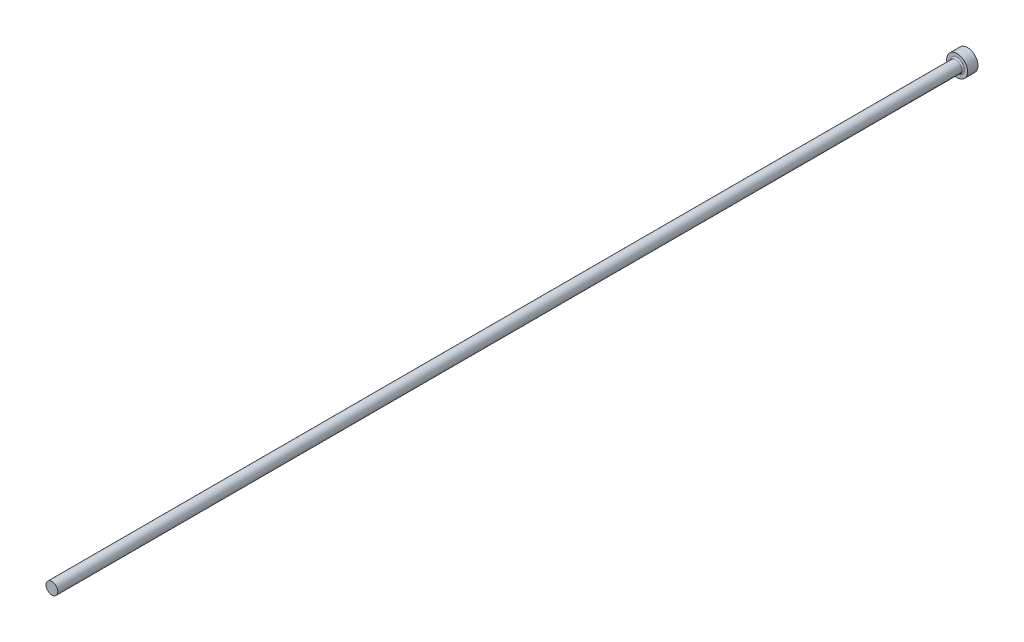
from build123d import *

# Parameters (mm, degrees)
FILLET1_R = 0.5


with BuildPart() as part:
    # FV → Revolve1 (revolve)
    with BuildSketch(Plane(origin=(0, 0, 0), x_dir=(1, 0, 0), z_dir=(0, 1, 0)), mode=Mode.PRIVATE) as revolve1_sk:
        Polygon((0, 0), (4, 0), (4, -4), (2.25, -4), (2.25, -350), (0, -350), align=None)
    revolve(revolve1_sk.sketch.rotate(Axis((0, 0, -9.033228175), (0, 0, 1)), 180), axis=Axis((0, 0, -9.033228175), (0, 0, 1)))

    # Fillet1
    fillet1_edges = [part.edges().sort_by_distance(p)[0] for p in [
        (2.25, 0, 4),
    ]]
    fillet(fillet1_edges, radius=FILLET1_R)


solid = part.part
